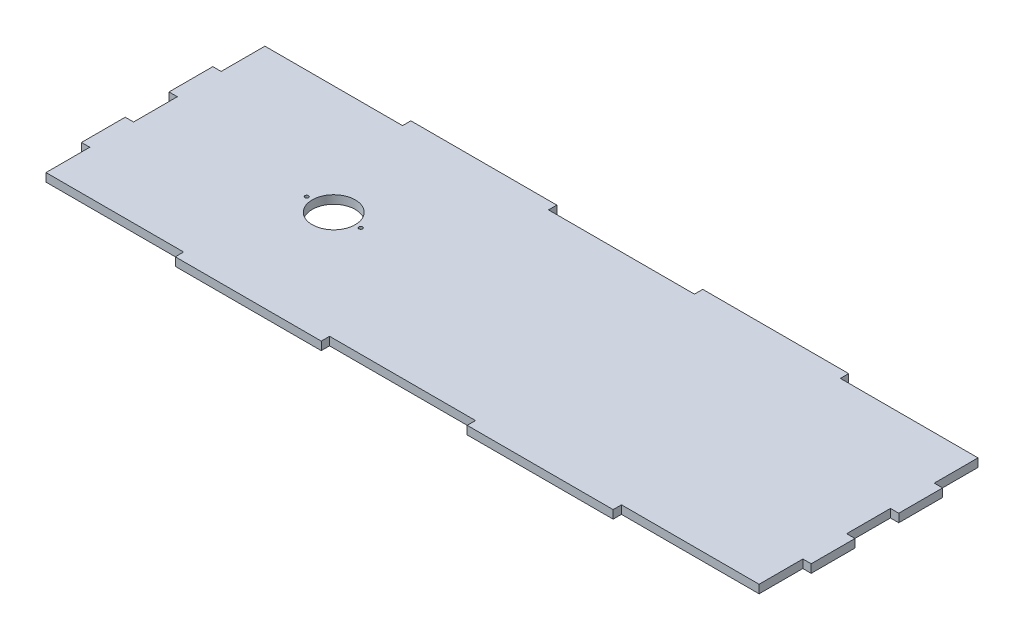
from build123d import *

# Parameters (mm, degrees)
BOSS_EXTRUDE3_DEPTH = 2.28
CUT_EXTRUDE2_DEPTH  = 10


with BuildPart() as part:
    # Sketch1 → Boss-Extrude3 (new body)
    with BuildSketch(Plane(origin=(0, 0, 0), x_dir=(1, 0, 0), z_dir=(0, 1, 0))):
        Polygon((20, 30), (-20, 30), (-20, 32.28), (-60, 32.28), (-60, 30), (-97.72, 30), (-97.72, 18), (-100, 18), (-100, 6), (-97.72, 6), (-97.72, -6), (-100, -6), (-100, -18), (-97.72, -18), (-97.72, -30), (-60, -30), (-60, -32.28), (-20, -32.28), (-20, -30), (20, -30), (20, -32.28), (60, -32.28), (60, -30), (97.72, -30), (97.72, -18), (100, -18), (100, -6), (97.72, -6), (97.72, 6), (100, 6), (100, 18), (97.72, 18), (97.72, 30), (60, 30), (60, 32.28), (20, 32.28), align=None)
    extrude(amount=BOSS_EXTRUDE3_DEPTH)

    # Sketch2 → Cut-Extrude2 (cut)
    with BuildSketch(Plane(origin=(0, 2.28, 0), x_dir=(1, 0, 0), z_dir=(0, 1, 0))):
        with BuildLine():
            ThreePointArc((-54.76, 0), (-48.86, -5.9), (-42.96, 0))
            Line((-42.96, 0), (-54.76, 0))
        make_face()
        with BuildLine():
            Line((-54.76, 0), (-42.96, 0))
            ThreePointArc((-42.96, 0), (-48.86, 5.9), (-54.76, 0))
        make_face()
        with BuildLine():
            ThreePointArc((-54.76, 0), (-48.86, -5.9), (-42.96, 0))
            Line((-42.96, 0), (-54.76, 0))
        make_face()
        with BuildLine():
            Line((-54.76, 0), (-42.96, 0))
            ThreePointArc((-42.96, 0), (-48.86, 5.9), (-54.76, 0))
        make_face()
        with BuildLine():
            ThreePointArc((-41.96, 0), (-41.46, -0.5), (-40.96, 0))
            Line((-40.96, 0), (-41.96, 0))
        make_face()
        with BuildLine():
            Line((-41.96, 0), (-40.96, 0))
            ThreePointArc((-40.96, 0), (-41.46, 0.5), (-41.96, 0))
        make_face()
        with BuildLine():
            ThreePointArc((-41.96, 0), (-41.46, -0.5), (-40.96, 0))
            Line((-40.96, 0), (-41.96, 0))
        make_face()
        with BuildLine():
            Line((-41.96, 0), (-40.96, 0))
            ThreePointArc((-40.96, 0), (-41.46, 0.5), (-41.96, 0))
        make_face()
        with BuildLine():
            ThreePointArc((-56.76, 0), (-56.26, -0.5), (-55.76, 0))
            Line((-55.76, 0), (-56.76, 0))
        make_face()
        with BuildLine():
            Line((-56.76, 0), (-55.76, 0))
            ThreePointArc((-55.76, 0), (-56.26, 0.5), (-56.76, 0))
        make_face()
        with BuildLine():
            ThreePointArc((-56.76, 0), (-56.26, -0.5), (-55.76, 0))
            Line((-55.76, 0), (-56.76, 0))
        make_face()
        with BuildLine():
            Line((-56.76, 0), (-55.76, 0))
            ThreePointArc((-55.76, 0), (-56.26, 0.5), (-56.76, 0))
        make_face()
    extrude(amount=-CUT_EXTRUDE2_DEPTH, mode=Mode.SUBTRACT)


solid = part.part
